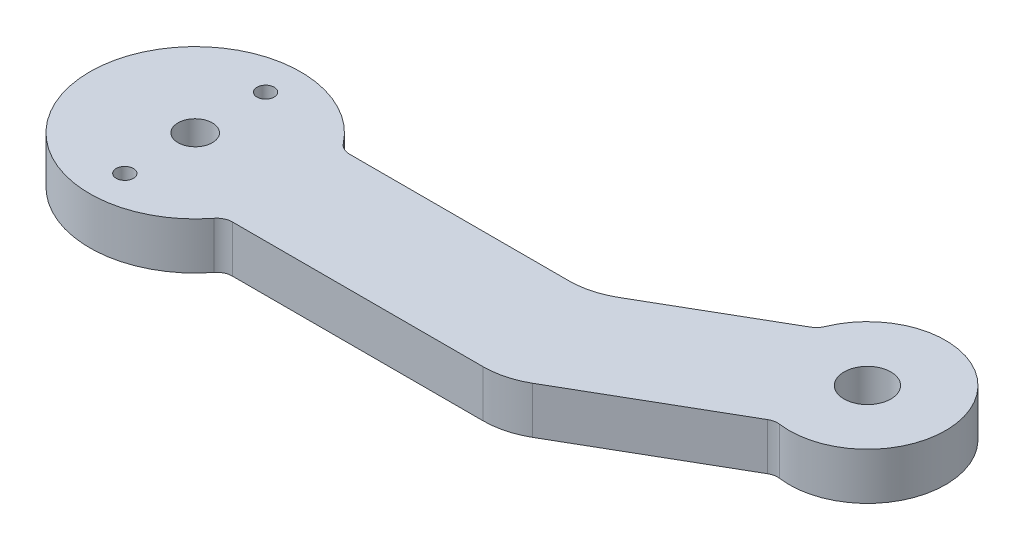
from build123d import *

# Parameters (mm, degrees)
ESQUISSE1_R      = 2.2
ESQUISSE1_R_2    = 1.1
ESQUISSE1_R_3    = 3
EXTRUSION1_DEPTH = 6


with BuildPart() as part:
    # Esquisse1 → Extrusion1 (new body)
    with BuildSketch(Plane(origin=(0, 0, 0), x_dir=(1, 0, 0), z_dir=(0, 1, 0))):
        with BuildLine():
            Line((12.247448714, -7.5), (44.330127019, -7.5))
            ThreePointArc((44.330127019, -7.5), (46.91831747, -7.159258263), (49.330127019, -6.160254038))
            Line((49.330127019, -6.160254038), (68.381549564, 4.839089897))
            ThreePointArc((68.381549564, 4.839089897), (68.994081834, 5.069147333), (69.648084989, 5.089199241))
            ThreePointArc((69.648084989, 5.089199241), (79.641016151, 20), (61.731418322, 18.801268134))
            ThreePointArc((61.731418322, 18.801268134), (61.387051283, 18.244910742), (60.881549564, 17.829470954))
            Line((60.881549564, 17.829470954), (45.310889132, 8.839745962))
            ThreePointArc((45.310889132, 8.839745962), (42.899079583, 7.840741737), (40.310889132, 7.5))
            Line((40.310889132, 7.5), (12.247448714, 7.5))
            ThreePointArc((12.247448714, 7.5), (11.367566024, 7.70394698), (10.667132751, 8.274193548))
            ThreePointArc((10.667132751, 8.274193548), (-13.5, 0), (10.667132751, -8.274193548))
            ThreePointArc((10.667132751, -8.274193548), (11.367566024, -7.70394698), (12.247448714, -7.5))
        make_face()
        with Locations(Location((0, 0, 0), (0, 0, 270))):
            Circle(ESQUISSE1_R, mode=Mode.SUBTRACT)
        with Locations(Location((0, 9, 0), (0, 0, 270))):
            Circle(ESQUISSE1_R_2, mode=Mode.SUBTRACT)
        with Locations(Location((0, -9, 0), (0, 0, 270))):
            Circle(ESQUISSE1_R_2, mode=Mode.SUBTRACT)
        with Locations(Location((70.980762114, 15, 0), (0, 0, 270))):
            Circle(ESQUISSE1_R_3, mode=Mode.SUBTRACT)
    extrude(amount=EXTRUSION1_DEPTH)


solid = part.part
